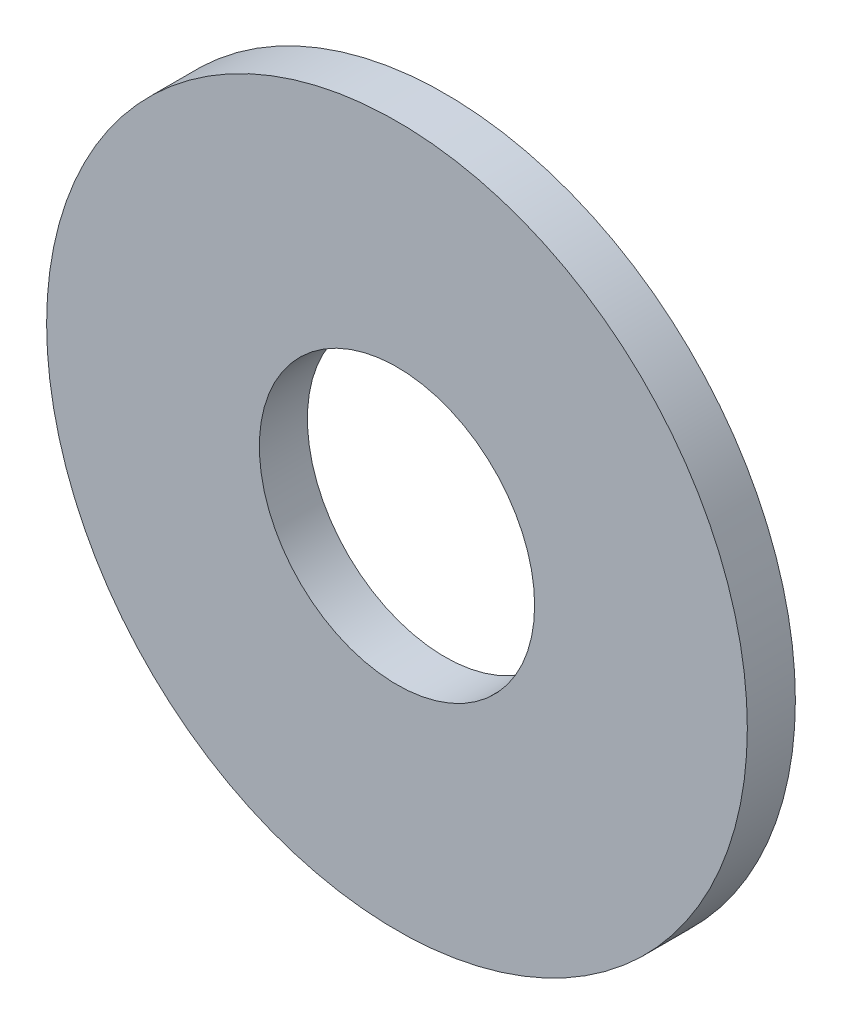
ISO-10303-21;
HEADER;
FILE_DESCRIPTION(('STEP AP214'),'2;1');
FILE_NAME('part.step','',(''),(''),'','','');
FILE_SCHEMA(('AUTOMOTIVE_DESIGN { 1 0 10303 214 1 1 1 1 }'));
ENDSEC;
DATA;
#1=APPLICATION_CONTEXT('core data for automotive mechanical design processes');
#2=APPLICATION_PROTOCOL_DEFINITION('international standard','automotive_design',2000,#1);
#3=PRODUCT_CONTEXT('',#1,'mechanical');
#4=PRODUCT('Part','Part','',(#3));
#5=PRODUCT_RELATED_PRODUCT_CATEGORY('part','',(#4));
#6=PRODUCT_DEFINITION_FORMATION('','',#4);
#7=PRODUCT_DEFINITION_CONTEXT('part definition',#1,'design');
#8=PRODUCT_DEFINITION('design','',#6,#7);
#9=PRODUCT_DEFINITION_SHAPE('','',#8);
#10=(LENGTH_UNIT() NAMED_UNIT(*) SI_UNIT(.MILLI.,.METRE.));
#11=(NAMED_UNIT(*) PLANE_ANGLE_UNIT() SI_UNIT($,.RADIAN.));
#12=(NAMED_UNIT(*) SI_UNIT($,.STERADIAN.) SOLID_ANGLE_UNIT());
#13=UNCERTAINTY_MEASURE_WITH_UNIT(LENGTH_MEASURE(1.E-05),#10,'distance_accuracy_value','');
#14=(GEOMETRIC_REPRESENTATION_CONTEXT(3) GLOBAL_UNCERTAINTY_ASSIGNED_CONTEXT((#13)) GLOBAL_UNIT_ASSIGNED_CONTEXT((#10,
#11,#12)) REPRESENTATION_CONTEXT('',''));
#15=CARTESIAN_POINT('',(0.,0.,0.));
#16=DIRECTION('',(0.,0.,1.));
#17=DIRECTION('',(1.,0.,0.));
#18=AXIS2_PLACEMENT_3D('',#15,#16,#17);
#19=CARTESIAN_POINT('',(0.,0.,-3.04800000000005));
#20=DIRECTION('',(0.,0.,1.));
#21=DIRECTION('',(1.,0.,0.));
#22=AXIS2_PLACEMENT_3D('',#19,#20,#21);
#23=CYLINDRICAL_SURFACE('',#22,22.225);
#24=CARTESIAN_POINT('',(0.,0.,-3.04800000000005));
#25=DIRECTION('',(0.,0.,1.));
#26=DIRECTION('',(1.,0.,0.));
#27=AXIS2_PLACEMENT_3D('',#24,#25,#26);
#28=CIRCLE('',#27,22.225);
#29=CARTESIAN_POINT('',(22.225,0.,-3.04800000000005));
#30=VERTEX_POINT('',#29);
#31=EDGE_CURVE('E12',#30,#30,#28,.T.);
#32=CARTESIAN_POINT('',(0.,0.,0.));
#33=DIRECTION('',(0.,0.,1.));
#34=DIRECTION('',(1.,0.,0.));
#35=AXIS2_PLACEMENT_3D('',#32,#33,#34);
#36=CIRCLE('',#35,22.225);
#37=CARTESIAN_POINT('',(22.225,0.,0.));
#38=VERTEX_POINT('',#37);
#39=EDGE_CURVE('E49',#38,#38,#36,.T.);
#40=CARTESIAN_POINT('',(22.225,0.,-3.04800000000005));
#41=CARTESIAN_POINT('',(22.225,0.,-3.01625000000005));
#42=CARTESIAN_POINT('',(22.225,0.,-2.98450000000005));
#43=CARTESIAN_POINT('',(22.225,0.,-2.92100000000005));
#44=CARTESIAN_POINT('',(22.225,0.,-2.88925000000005));
#45=CARTESIAN_POINT('',(22.225,0.,-2.82575000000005));
#46=CARTESIAN_POINT('',(22.225,0.,-2.79400000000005));
#47=CARTESIAN_POINT('',(22.225,0.,-2.73050000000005));
#48=CARTESIAN_POINT('',(22.225,0.,-2.69875000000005));
#49=CARTESIAN_POINT('',(22.225,0.,-2.63525000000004));
#50=CARTESIAN_POINT('',(22.225,0.,-2.60350000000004));
#51=CARTESIAN_POINT('',(22.225,0.,-2.54000000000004));
#52=CARTESIAN_POINT('',(22.225,0.,-2.50825000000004));
#53=CARTESIAN_POINT('',(22.225,0.,-2.44475000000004));
#54=CARTESIAN_POINT('',(22.225,0.,-2.41300000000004));
#55=CARTESIAN_POINT('',(22.225,0.,-2.34950000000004));
#56=CARTESIAN_POINT('',(22.225,0.,-2.31775000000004));
#57=CARTESIAN_POINT('',(22.225,0.,-2.25425000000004));
#58=CARTESIAN_POINT('',(22.225,0.,-2.22250000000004));
#59=CARTESIAN_POINT('',(22.225,0.,-2.15900000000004));
#60=CARTESIAN_POINT('',(22.225,0.,-2.12725000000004));
#61=CARTESIAN_POINT('',(22.225,0.,-2.06375000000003));
#62=CARTESIAN_POINT('',(22.225,0.,-2.03200000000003));
#63=CARTESIAN_POINT('',(22.225,0.,-1.96850000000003));
#64=CARTESIAN_POINT('',(22.225,0.,-1.93675000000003));
#65=CARTESIAN_POINT('',(22.225,0.,-1.87325000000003));
#66=CARTESIAN_POINT('',(22.225,0.,-1.84150000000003));
#67=CARTESIAN_POINT('',(22.225,0.,-1.77800000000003));
#68=CARTESIAN_POINT('',(22.225,0.,-1.74625000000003));
#69=CARTESIAN_POINT('',(22.225,0.,-1.68275000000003));
#70=CARTESIAN_POINT('',(22.225,0.,-1.65100000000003));
#71=CARTESIAN_POINT('',(22.225,0.,-1.58750000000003));
#72=CARTESIAN_POINT('',(22.225,0.,-1.55575000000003));
#73=CARTESIAN_POINT('',(22.225,0.,-1.49225000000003));
#74=CARTESIAN_POINT('',(22.225,0.,-1.46050000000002));
#75=CARTESIAN_POINT('',(22.225,0.,-1.39700000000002));
#76=CARTESIAN_POINT('',(22.225,0.,-1.36525000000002));
#77=CARTESIAN_POINT('',(22.225,0.,-1.30175000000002));
#78=CARTESIAN_POINT('',(22.225,0.,-1.27000000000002));
#79=CARTESIAN_POINT('',(22.225,0.,-1.20650000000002));
#80=CARTESIAN_POINT('',(22.225,0.,-1.17475000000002));
#81=CARTESIAN_POINT('',(22.225,0.,-1.11125000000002));
#82=CARTESIAN_POINT('',(22.225,0.,-1.07950000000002));
#83=CARTESIAN_POINT('',(22.225,0.,-1.01600000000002));
#84=CARTESIAN_POINT('',(22.225,0.,-0.984250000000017));
#85=CARTESIAN_POINT('',(22.225,0.,-0.920750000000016));
#86=CARTESIAN_POINT('',(22.225,0.,-0.889000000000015));
#87=CARTESIAN_POINT('',(22.225,0.,-0.825500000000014));
#88=CARTESIAN_POINT('',(22.225,0.,-0.793750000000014));
#89=CARTESIAN_POINT('',(22.225,0.,-0.730250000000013));
#90=CARTESIAN_POINT('',(22.225,0.,-0.698500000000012));
#91=CARTESIAN_POINT('',(22.225,0.,-0.635000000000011));
#92=CARTESIAN_POINT('',(22.225,0.,-0.603250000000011));
#93=CARTESIAN_POINT('',(22.225,0.,-0.539750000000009));
#94=CARTESIAN_POINT('',(22.225,0.,-0.508000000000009));
#95=CARTESIAN_POINT('',(22.225,0.,-0.444500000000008));
#96=CARTESIAN_POINT('',(22.225,0.,-0.412750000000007));
#97=CARTESIAN_POINT('',(22.225,0.,-0.349250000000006));
#98=CARTESIAN_POINT('',(22.225,0.,-0.317500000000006));
#99=CARTESIAN_POINT('',(22.225,0.,-0.254000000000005));
#100=CARTESIAN_POINT('',(22.225,0.,-0.222250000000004));
#101=CARTESIAN_POINT('',(22.225,0.,-0.158750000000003));
#102=CARTESIAN_POINT('',(22.225,0.,-0.127000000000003));
#103=CARTESIAN_POINT('',(22.225,0.,-0.0635000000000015));
#104=CARTESIAN_POINT('',(22.225,0.,-0.031750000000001));
#105=CARTESIAN_POINT('',(22.225,0.,0.));
#106=B_SPLINE_CURVE_WITH_KNOTS('',3,(#40,#41,#42,#43,#44,#45,#46,#47,#48,#49,#50,#51,#52,#53,
#54,#55,#56,#57,#58,#59,#60,#61,#62,#63,#64,#65,#66,#67,#68,#69,#70,#71,#72,#73,#74,#75,#76,#77,
#78,#79,#80,#81,#82,#83,#84,#85,#86,#87,#88,#89,#90,#91,#92,#93,#94,#95,#96,#97,#98,#99,#100,
#101,#102,#103,#104,#105),.UNSPECIFIED.,.F.,.F.,(4,2,2,2,2,2,2,2,2,2,2,2,2,2,2,2,2,2,2,2,2,2,2,
2,2,2,2,2,2,2,2,2,4),(0.,0.0952500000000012,0.190500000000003,0.285750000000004,
0.381000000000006,0.476250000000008,0.571500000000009,0.666750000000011,0.762000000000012,
0.857250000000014,0.952500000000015,1.04775000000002,1.14300000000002,1.23825000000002,
1.33350000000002,1.42875000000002,1.52400000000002,1.61925000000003,1.71450000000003,
1.80975000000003,1.90500000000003,2.00025000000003,2.09550000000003,2.19075000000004,
2.28600000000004,2.38125000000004,2.47650000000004,2.57175000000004,2.66700000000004,
2.76225000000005,2.85750000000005,2.95275000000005,3.04800000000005),.UNSPECIFIED.);
#107=EDGE_CURVE('BSEAM46',#30,#38,#106,.T.);
#108=ORIENTED_EDGE('',*,*,#31,.T.);
#109=ORIENTED_EDGE('',*,*,#39,.F.);
#110=ORIENTED_EDGE('',*,*,#107,.T.);
#111=ORIENTED_EDGE('',*,*,#107,.F.);
#112=EDGE_LOOP('',(#108,#110,#109,#111));
#113=FACE_BOUND('',#112,.T.);
#114=ADVANCED_FACE('F46',(#113),#23,.T.);
#115=CARTESIAN_POINT('',(0.,0.,-3.04800000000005));
#116=DIRECTION('',(0.,0.,1.));
#117=DIRECTION('',(1.,0.,0.));
#118=AXIS2_PLACEMENT_3D('',#115,#116,#117);
#119=PLANE('',#118);
#120=CARTESIAN_POINT('',(0.,0.,-3.04800000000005));
#121=DIRECTION('',(0.,0.,1.));
#122=DIRECTION('',(1.,0.,0.));
#123=AXIS2_PLACEMENT_3D('',#120,#121,#122);
#124=CIRCLE('',#123,8.73125);
#125=CARTESIAN_POINT('',(8.73125,0.,-3.04800000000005));
#126=VERTEX_POINT('',#125);
#127=EDGE_CURVE('E56',#126,#126,#124,.T.);
#128=ORIENTED_EDGE('',*,*,#127,.T.);
#129=EDGE_LOOP('',(#128));
#130=FACE_BOUND('',#129,.T.);
#131=ORIENTED_EDGE('',*,*,#31,.F.);
#132=EDGE_LOOP('',(#131));
#133=FACE_BOUND('',#132,.T.);
#134=ADVANCED_FACE('F64',(#130,#133),#119,.F.);
#135=CARTESIAN_POINT('',(0.,0.,0.));
#136=DIRECTION('',(0.,0.,1.));
#137=DIRECTION('',(1.,0.,0.));
#138=AXIS2_PLACEMENT_3D('',#135,#136,#137);
#139=PLANE('',#138);
#140=CARTESIAN_POINT('',(0.,0.,0.));
#141=DIRECTION('',(0.,0.,1.));
#142=DIRECTION('',(1.,0.,0.));
#143=AXIS2_PLACEMENT_3D('',#140,#141,#142);
#144=CIRCLE('',#143,8.73125);
#145=CARTESIAN_POINT('',(8.73125,0.,0.));
#146=VERTEX_POINT('',#145);
#147=EDGE_CURVE('E58',#146,#146,#144,.T.);
#148=ORIENTED_EDGE('',*,*,#147,.F.);
#149=EDGE_LOOP('',(#148));
#150=FACE_BOUND('',#149,.T.);
#151=ORIENTED_EDGE('',*,*,#39,.T.);
#152=EDGE_LOOP('',(#151));
#153=FACE_BOUND('',#152,.T.);
#154=ADVANCED_FACE('F70',(#150,#153),#139,.T.);
#155=CARTESIAN_POINT('',(0.,0.,-3.04800000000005));
#156=DIRECTION('',(0.,0.,1.));
#157=DIRECTION('',(1.,0.,0.));
#158=AXIS2_PLACEMENT_3D('',#155,#156,#157);
#159=CYLINDRICAL_SURFACE('',#158,8.73125);
#160=CARTESIAN_POINT('',(8.73125,0.,-3.04800000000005));
#161=CARTESIAN_POINT('',(8.73125,0.,-3.01625000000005));
#162=CARTESIAN_POINT('',(8.73125,0.,-2.98450000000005));
#163=CARTESIAN_POINT('',(8.73125,0.,-2.92100000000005));
#164=CARTESIAN_POINT('',(8.73125,0.,-2.88925000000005));
#165=CARTESIAN_POINT('',(8.73125,0.,-2.82575000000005));
#166=CARTESIAN_POINT('',(8.73125,0.,-2.79400000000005));
#167=CARTESIAN_POINT('',(8.73125,0.,-2.73050000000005));
#168=CARTESIAN_POINT('',(8.73125,0.,-2.69875000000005));
#169=CARTESIAN_POINT('',(8.73125,0.,-2.63525000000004));
#170=CARTESIAN_POINT('',(8.73125,0.,-2.60350000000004));
#171=CARTESIAN_POINT('',(8.73125,0.,-2.54000000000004));
#172=CARTESIAN_POINT('',(8.73125,0.,-2.50825000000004));
#173=CARTESIAN_POINT('',(8.73125,0.,-2.44475000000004));
#174=CARTESIAN_POINT('',(8.73125,0.,-2.41300000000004));
#175=CARTESIAN_POINT('',(8.73125,0.,-2.34950000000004));
#176=CARTESIAN_POINT('',(8.73125,0.,-2.31775000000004));
#177=CARTESIAN_POINT('',(8.73125,0.,-2.25425000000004));
#178=CARTESIAN_POINT('',(8.73125,0.,-2.22250000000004));
#179=CARTESIAN_POINT('',(8.73125,0.,-2.15900000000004));
#180=CARTESIAN_POINT('',(8.73125,0.,-2.12725000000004));
#181=CARTESIAN_POINT('',(8.73125,0.,-2.06375000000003));
#182=CARTESIAN_POINT('',(8.73125,0.,-2.03200000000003));
#183=CARTESIAN_POINT('',(8.73125,0.,-1.96850000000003));
#184=CARTESIAN_POINT('',(8.73125,0.,-1.93675000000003));
#185=CARTESIAN_POINT('',(8.73125,0.,-1.87325000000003));
#186=CARTESIAN_POINT('',(8.73125,0.,-1.84150000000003));
#187=CARTESIAN_POINT('',(8.73125,0.,-1.77800000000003));
#188=CARTESIAN_POINT('',(8.73125,0.,-1.74625000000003));
#189=CARTESIAN_POINT('',(8.73125,0.,-1.68275000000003));
#190=CARTESIAN_POINT('',(8.73125,0.,-1.65100000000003));
#191=CARTESIAN_POINT('',(8.73125,0.,-1.58750000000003));
#192=CARTESIAN_POINT('',(8.73125,0.,-1.55575000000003));
#193=CARTESIAN_POINT('',(8.73125,0.,-1.49225000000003));
#194=CARTESIAN_POINT('',(8.73125,0.,-1.46050000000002));
#195=CARTESIAN_POINT('',(8.73125,0.,-1.39700000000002));
#196=CARTESIAN_POINT('',(8.73125,0.,-1.36525000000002));
#197=CARTESIAN_POINT('',(8.73125,0.,-1.30175000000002));
#198=CARTESIAN_POINT('',(8.73125,0.,-1.27000000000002));
#199=CARTESIAN_POINT('',(8.73125,0.,-1.20650000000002));
#200=CARTESIAN_POINT('',(8.73125,0.,-1.17475000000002));
#201=CARTESIAN_POINT('',(8.73125,0.,-1.11125000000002));
#202=CARTESIAN_POINT('',(8.73125,0.,-1.07950000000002));
#203=CARTESIAN_POINT('',(8.73125,0.,-1.01600000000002));
#204=CARTESIAN_POINT('',(8.73125,0.,-0.984250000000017));
#205=CARTESIAN_POINT('',(8.73125,0.,-0.920750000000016));
#206=CARTESIAN_POINT('',(8.73125,0.,-0.889000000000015));
#207=CARTESIAN_POINT('',(8.73125,0.,-0.825500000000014));
#208=CARTESIAN_POINT('',(8.73125,0.,-0.793750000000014));
#209=CARTESIAN_POINT('',(8.73125,0.,-0.730250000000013));
#210=CARTESIAN_POINT('',(8.73125,0.,-0.698500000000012));
#211=CARTESIAN_POINT('',(8.73125,0.,-0.635000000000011));
#212=CARTESIAN_POINT('',(8.73125,0.,-0.603250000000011));
#213=CARTESIAN_POINT('',(8.73125,0.,-0.539750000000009));
#214=CARTESIAN_POINT('',(8.73125,0.,-0.508000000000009));
#215=CARTESIAN_POINT('',(8.73125,0.,-0.444500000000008));
#216=CARTESIAN_POINT('',(8.73125,0.,-0.412750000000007));
#217=CARTESIAN_POINT('',(8.73125,0.,-0.349250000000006));
#218=CARTESIAN_POINT('',(8.73125,0.,-0.317500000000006));
#219=CARTESIAN_POINT('',(8.73125,0.,-0.254000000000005));
#220=CARTESIAN_POINT('',(8.73125,0.,-0.222250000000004));
#221=CARTESIAN_POINT('',(8.73125,0.,-0.158750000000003));
#222=CARTESIAN_POINT('',(8.73125,0.,-0.127000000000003));
#223=CARTESIAN_POINT('',(8.73125,0.,-0.0635000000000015));
#224=CARTESIAN_POINT('',(8.73125,0.,-0.031750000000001));
#225=CARTESIAN_POINT('',(8.73125,0.,0.));
#226=B_SPLINE_CURVE_WITH_KNOTS('',3,(#160,#161,#162,#163,#164,#165,#166,#167,#168,#169,#170,
#171,#172,#173,#174,#175,#176,#177,#178,#179,#180,#181,#182,#183,#184,#185,#186,#187,#188,#189,
#190,#191,#192,#193,#194,#195,#196,#197,#198,#199,#200,#201,#202,#203,#204,#205,#206,#207,#208,
#209,#210,#211,#212,#213,#214,#215,#216,#217,#218,#219,#220,#221,#222,#223,#224,#225),
.UNSPECIFIED.,.F.,.F.,(4,2,2,2,2,2,2,2,2,2,2,2,2,2,2,2,2,2,2,2,2,2,2,2,2,2,2,2,2,2,2,2,4),(0.,
0.0952500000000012,0.190500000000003,0.285750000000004,0.381000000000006,0.476250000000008,
0.571500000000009,0.666750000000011,0.762000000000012,0.857250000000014,0.952500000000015,
1.04775000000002,1.14300000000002,1.23825000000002,1.33350000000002,1.42875000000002,
1.52400000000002,1.61925000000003,1.71450000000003,1.80975000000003,1.90500000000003,
2.00025000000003,2.09550000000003,2.19075000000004,2.28600000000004,2.38125000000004,
2.47650000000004,2.57175000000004,2.66700000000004,2.76225000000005,2.85750000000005,
2.95275000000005,3.04800000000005),.UNSPECIFIED.);
#227=EDGE_CURVE('BSEAM67',#126,#146,#226,.T.);
#228=ORIENTED_EDGE('',*,*,#127,.F.);
#229=ORIENTED_EDGE('',*,*,#147,.T.);
#230=ORIENTED_EDGE('',*,*,#227,.T.);
#231=ORIENTED_EDGE('',*,*,#227,.F.);
#232=EDGE_LOOP('',(#228,#230,#229,#231));
#233=FACE_BOUND('',#232,.T.);
#234=ADVANCED_FACE('F67',(#233),#159,.F.);
#235=CLOSED_SHELL('',(#114,#134,#154,#234));
#236=MANIFOLD_SOLID_BREP('B2',#235);
#237=ADVANCED_BREP_SHAPE_REPRESENTATION('',(#18,#236),#14);
#238=SHAPE_DEFINITION_REPRESENTATION(#9,#237);
ENDSEC;
END-ISO-10303-21;
